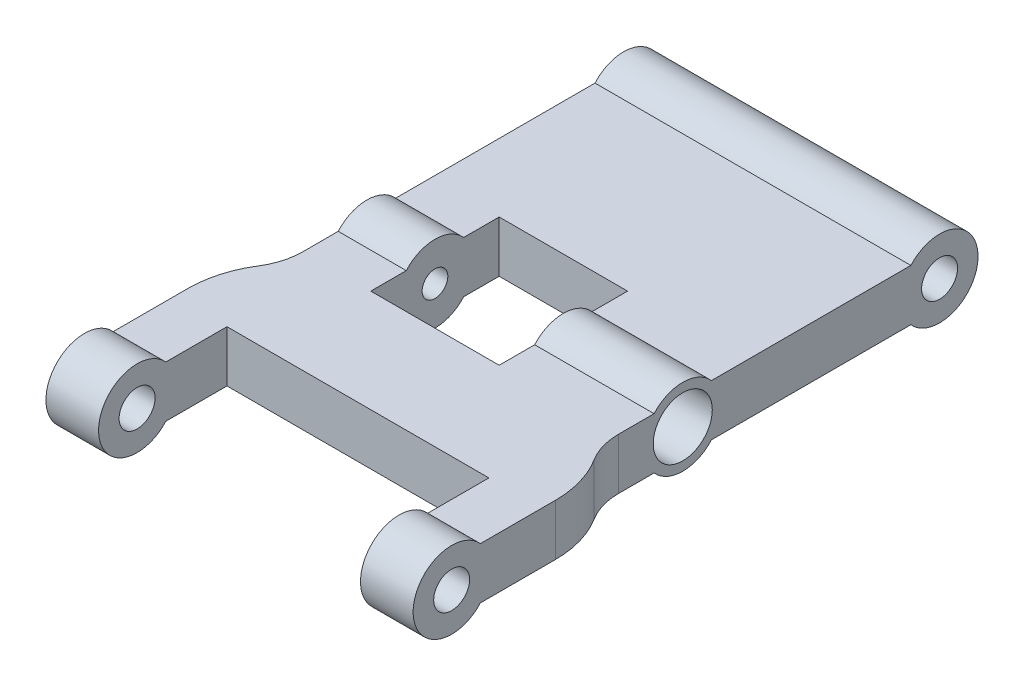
from build123d import *

# Parameters (mm, degrees)
SKETCH1_W                = 50.8
SKETCH1_H                = 5.08
BOSS_EXTRUDE1_DEPTH      = 31.242
SKETCH2_R                = 3.81
BOSS_EXTRUDE2_DEPTH      = 31.242
SKETCH7_R                = 3.81
BOSS_EXTRUDE3_DEPTH      = 31.242
SKETCH5_R                = 1.27
CUT_EXTRUDE5_DEPTH       = 64.234778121
CUT_EXTRUDE6_DEPTH       = 64.234778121
CUT_EXTRUDE6_DEPTH_BACK  = 64.234778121
SKETCH4_W                = 12.7
SKETCH4_H                = 12.7
SKETCH8_R                = 2.921
CUT_EXTRUDE7_DEPTH       = 9.271
CUT_EXTRUDE8_START       = -4.191
SKETCH9_R                = 2.921
CUT_EXTRUDE8_DEPTH       = 4.191
BOSS_EXTRUDE4_DEPTH      = 2.54
BOSS_EXTRUDE4_DEPTH_BACK = 33.782
CUT_EXTRUDE9_DEPTH       = 65.527498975
FILLET1_R                = 10.16
CUT_EXTRUDE10_DEPTH      = 65.527498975
CUT_EXTRUDE10_DEPTH_BACK = 65.527498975
SKETCH12_W               = 25.908
SKETCH12_H               = 15.993311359
CUT_EXTRUDE11_DEPTH      = 65.527498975
CUT_EXTRUDE11_DEPTH_BACK = 65.527498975
SKETCH6_R                = 1.778


with BuildPart() as part:
    # Sketch1 → Boss-Extrude1 (new body)
    with BuildSketch(Plane(origin=(0, 0, 0), x_dir=(0, 0, -1), z_dir=(1, 0, 0))):
        with Locations((25.4, 2.54)):
            Rectangle(SKETCH1_W, SKETCH1_H)
    extrude(amount=BOSS_EXTRUDE1_DEPTH)

    # Sketch2 → Boss-Extrude2 (add)
    with BuildSketch(Plane(origin=(31.242, 0, 0), x_dir=(0, 0, -1), z_dir=(1, 0, 0))):
        with Locations((0, 2.54)):
            Circle(SKETCH2_R)
        with Locations((50.8, 2.54)):
            Circle(SKETCH2_R)
    extrude(amount=-BOSS_EXTRUDE2_DEPTH)

    # Sketch7 → Boss-Extrude3 (add)
    with BuildSketch(Plane.ZY):
        with Locations((-25.4, 2.54)):
            Circle(SKETCH7_R)
    extrude(amount=-BOSS_EXTRUDE3_DEPTH)

    # Sketch5 → Cut-Extrude5 (cut, through all)
    with BuildSketch(Plane.ZY):
        with Locations((-25.4, 2.54)):
            Circle(SKETCH5_R)
    extrude(amount=-CUT_EXTRUDE5_DEPTH, mode=Mode.SUBTRACT)

    # Sketch4 → Cut-Extrude6 (cut, two sides: drawn at the far end of the back side and taken through both)
    with BuildSketch(Plane(origin=(0, 5.08, 0), x_dir=(1, 0, 0), z_dir=(0, 1, 0)).offset(-CUT_EXTRUDE6_DEPTH_BACK)):
        with Locations((13.081, 25.4)):
            Rectangle(SKETCH4_W, SKETCH4_H)
    extrude(amount=CUT_EXTRUDE6_DEPTH + CUT_EXTRUDE6_DEPTH_BACK, mode=Mode.SUBTRACT)

    # Sketch8 → Cut-Extrude7 (cut)
    with BuildSketch(Plane(origin=(31.242, 0, 0), x_dir=(0, 0, -1), z_dir=(1, 0, 0))):
        with Locations((25.4, 2.54)):
            Circle(SKETCH8_R)
    extrude(amount=-CUT_EXTRUDE7_DEPTH, mode=Mode.SUBTRACT)

    # Sketch9 → Cut-Extrude8 (cut)
    with BuildSketch(Plane.ZY.offset(CUT_EXTRUDE8_START)):
        with Locations(Location((-25.4, 2.54, 0), (0, 0, 180))):
            Circle(SKETCH9_R)
    extrude(amount=CUT_EXTRUDE8_DEPTH, mode=Mode.SUBTRACT)

    # Sketch10 → Boss-Extrude4 (add, two sides: drawn at the far end of the back side and taken through both)
    with BuildSketch(Plane(origin=(31.242, 0, 0), x_dir=(0, 0, -1), z_dir=(1, 0, 0)).offset(-BOSS_EXTRUDE4_DEPTH_BACK)):
        with BuildLine():
            Line((2.839806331, 5.08), (19.05, 5.08))
            Line((19.05, 5.08), (19.05, 0))
            Line((19.05, 0), (2.839806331, 0))
            ThreePointArc((2.839806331, 0), (-3.81, 2.54), (2.839806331, 5.08))
        make_face()
    extrude(amount=BOSS_EXTRUDE4_DEPTH + BOSS_EXTRUDE4_DEPTH_BACK)

    # Sketch11 → Cut-Extrude9 (cut, through all)
    with BuildSketch(Plane(origin=(0, 5.08, 0), x_dir=(1, 0, 0), z_dir=(0, 1, 0))):
        with BuildLine():
            Line((0, 22.560193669), (-7.62, 22.560193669))
            Line((-7.62, 22.560193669), (-7.62, 12.7))
            Line((-7.62, 12.7), (-6.35, 12.7))
            ThreePointArc((-6.35, 12.7), (-1.859871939, 14.559871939), (0, 19.05))
            Line((0, 19.05), (0, 22.560193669))
        make_face()
        with BuildLine():
            Line((31.242, 22.560193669), (38.862, 22.560193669))
            Line((38.862, 22.560193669), (38.862, 12.7))
            Line((38.862, 12.7), (37.592, 12.7))
            ThreePointArc((37.592, 12.7), (33.101871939, 14.559871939), (31.242, 19.05))
            Line((31.242, 19.05), (31.242, 22.560193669))
        make_face()
    extrude(amount=-CUT_EXTRUDE9_DEPTH, mode=Mode.SUBTRACT)

    # Fillet1
    fillet1_edges = [part.edges().sort_by_distance(p)[0] for p in [
        (33.782, 2.54, -13.97),
        (-2.54, 2.54, -13.97),
    ]]
    fillet(fillet1_edges, radius=FILLET1_R)

    # Sketch12 → Cut-Extrude10 (cut, two sides: drawn at the far end of the back side and taken through both)
    with BuildSketch(Plane(origin=(0, 5.08, 0), x_dir=(1, 0, 0), z_dir=(0, 1, 0)).offset(-CUT_EXTRUDE10_DEPTH_BACK)):
        with Locations((15.621, 0.893344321)):
            Rectangle(SKETCH12_W, SKETCH12_H)
    extrude(amount=CUT_EXTRUDE10_DEPTH + CUT_EXTRUDE10_DEPTH_BACK, mode=Mode.SUBTRACT)

    # Sketch6 → Cut-Extrude11 (cut, two sides: drawn at the far end of the back side and taken through both)
    with BuildSketch(Plane.ZY.offset(-CUT_EXTRUDE11_DEPTH_BACK)):
        with Locations((-50.8, 2.54)):
            Circle(SKETCH6_R)
        with Locations((0, 2.54)):
            Circle(SKETCH6_R)
    extrude(amount=CUT_EXTRUDE11_DEPTH + CUT_EXTRUDE11_DEPTH_BACK, mode=Mode.SUBTRACT)


solid = part.part
